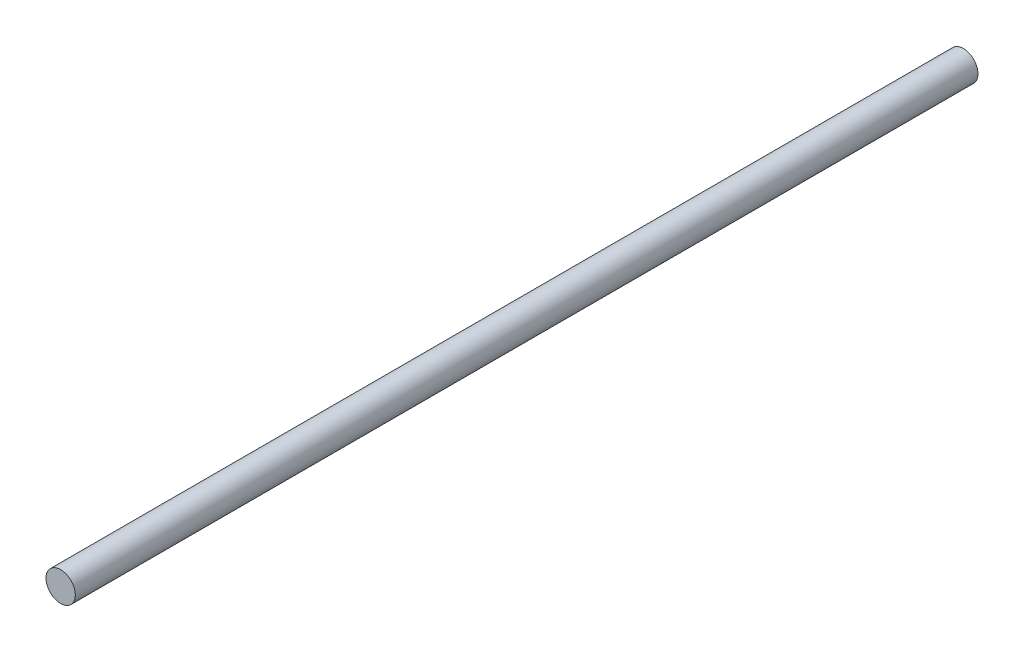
ISO-10303-21;
HEADER;
FILE_DESCRIPTION(('STEP AP214'),'2;1');
FILE_NAME('part.step','',(''),(''),'','','');
FILE_SCHEMA(('AUTOMOTIVE_DESIGN { 1 0 10303 214 1 1 1 1 }'));
ENDSEC;
DATA;
#1=APPLICATION_CONTEXT('core data for automotive mechanical design processes');
#2=APPLICATION_PROTOCOL_DEFINITION('international standard','automotive_design',2000,#1);
#3=PRODUCT_CONTEXT('',#1,'mechanical');
#4=PRODUCT('Part','Part','',(#3));
#5=PRODUCT_RELATED_PRODUCT_CATEGORY('part','',(#4));
#6=PRODUCT_DEFINITION_FORMATION('','',#4);
#7=PRODUCT_DEFINITION_CONTEXT('part definition',#1,'design');
#8=PRODUCT_DEFINITION('design','',#6,#7);
#9=PRODUCT_DEFINITION_SHAPE('','',#8);
#10=(LENGTH_UNIT() NAMED_UNIT(*) SI_UNIT(.MILLI.,.METRE.));
#11=(NAMED_UNIT(*) PLANE_ANGLE_UNIT() SI_UNIT($,.RADIAN.));
#12=(NAMED_UNIT(*) SI_UNIT($,.STERADIAN.) SOLID_ANGLE_UNIT());
#13=UNCERTAINTY_MEASURE_WITH_UNIT(LENGTH_MEASURE(1.E-05),#10,'distance_accuracy_value','');
#14=(GEOMETRIC_REPRESENTATION_CONTEXT(3) GLOBAL_UNCERTAINTY_ASSIGNED_CONTEXT((#13)) GLOBAL_UNIT_ASSIGNED_CONTEXT((#10,
#11,#12)) REPRESENTATION_CONTEXT('',''));
#15=CARTESIAN_POINT('',(0.,0.,0.));
#16=DIRECTION('',(0.,0.,1.));
#17=DIRECTION('',(1.,0.,0.));
#18=AXIS2_PLACEMENT_3D('',#15,#16,#17);
#19=CARTESIAN_POINT('',(0.,0.,1952.752));
#20=DIRECTION('',(0.,0.,-1.));
#21=DIRECTION('',(-1.,0.,0.));
#22=AXIS2_PLACEMENT_3D('',#19,#20,#21);
#23=CYLINDRICAL_SURFACE('',#22,31.73095);
#24=CARTESIAN_POINT('',(0.,0.,1952.752));
#25=DIRECTION('',(0.,0.,1.));
#26=DIRECTION('',(1.,0.,0.));
#27=AXIS2_PLACEMENT_3D('',#24,#25,#26);
#28=CIRCLE('',#27,31.73095);
#29=CARTESIAN_POINT('',(31.73095,0.,1952.752));
#30=VERTEX_POINT('',#29);
#31=EDGE_CURVE('E10',#30,#30,#28,.T.);
#32=ORIENTED_EDGE('',*,*,#31,.F.);
#33=EDGE_LOOP('',(#32));
#34=FACE_BOUND('',#33,.T.);
#35=CARTESIAN_POINT('',(0.,0.,0.));
#36=DIRECTION('',(0.,0.,1.));
#37=DIRECTION('',(1.,0.,0.));
#38=AXIS2_PLACEMENT_3D('',#35,#36,#37);
#39=CIRCLE('',#38,31.73095);
#40=CARTESIAN_POINT('',(31.73095,0.,0.));
#41=VERTEX_POINT('',#40);
#42=EDGE_CURVE('E44',#41,#41,#39,.T.);
#43=ORIENTED_EDGE('',*,*,#42,.T.);
#44=EDGE_LOOP('',(#43));
#45=FACE_BOUND('',#44,.T.);
#46=ADVANCED_FACE('F41',(#34,#45),#23,.T.);
#47=CARTESIAN_POINT('',(0.,0.,1952.752));
#48=DIRECTION('',(0.,0.,1.));
#49=DIRECTION('',(1.,0.,0.));
#50=AXIS2_PLACEMENT_3D('',#47,#48,#49);
#51=PLANE('',#50);
#52=ORIENTED_EDGE('',*,*,#31,.T.);
#53=EDGE_LOOP('',(#52));
#54=FACE_BOUND('',#53,.T.);
#55=ADVANCED_FACE('F56',(#54),#51,.T.);
#56=CARTESIAN_POINT('',(0.,0.,0.));
#57=DIRECTION('',(0.,0.,1.));
#58=DIRECTION('',(1.,0.,0.));
#59=AXIS2_PLACEMENT_3D('',#56,#57,#58);
#60=PLANE('',#59);
#61=ORIENTED_EDGE('',*,*,#42,.F.);
#62=EDGE_LOOP('',(#61));
#63=FACE_BOUND('',#62,.T.);
#64=ADVANCED_FACE('F54',(#63),#60,.F.);
#65=CLOSED_SHELL('',(#46,#55,#64));
#66=MANIFOLD_SOLID_BREP('B2',#65);
#67=ADVANCED_BREP_SHAPE_REPRESENTATION('',(#18,#66),#14);
#68=SHAPE_DEFINITION_REPRESENTATION(#9,#67);
ENDSEC;
END-ISO-10303-21;
